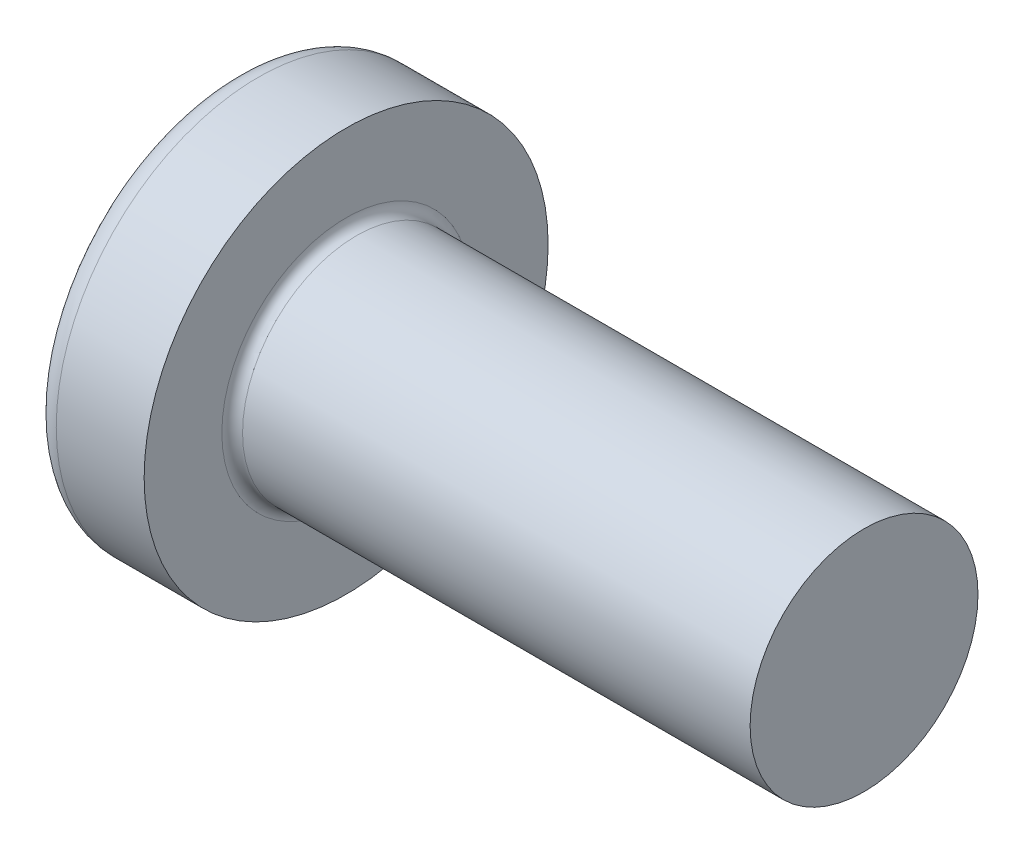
ISO-10303-21;
HEADER;
FILE_DESCRIPTION(('STEP AP214'),'2;1');
FILE_NAME('part.step','',(''),(''),'','','');
FILE_SCHEMA(('AUTOMOTIVE_DESIGN { 1 0 10303 214 1 1 1 1 }'));
ENDSEC;
DATA;
#1=APPLICATION_CONTEXT('core data for automotive mechanical design processes');
#2=APPLICATION_PROTOCOL_DEFINITION('international standard','automotive_design',2000,#1);
#3=PRODUCT_CONTEXT('',#1,'mechanical');
#4=PRODUCT('Part','Part','',(#3));
#5=PRODUCT_RELATED_PRODUCT_CATEGORY('part','',(#4));
#6=PRODUCT_DEFINITION_FORMATION('','',#4);
#7=PRODUCT_DEFINITION_CONTEXT('part definition',#1,'design');
#8=PRODUCT_DEFINITION('design','',#6,#7);
#9=PRODUCT_DEFINITION_SHAPE('','',#8);
#10=(LENGTH_UNIT() NAMED_UNIT(*) SI_UNIT(.MILLI.,.METRE.));
#11=(NAMED_UNIT(*) PLANE_ANGLE_UNIT() SI_UNIT($,.RADIAN.));
#12=(NAMED_UNIT(*) SI_UNIT($,.STERADIAN.) SOLID_ANGLE_UNIT());
#13=UNCERTAINTY_MEASURE_WITH_UNIT(LENGTH_MEASURE(1.E-05),#10,'distance_accuracy_value','');
#14=(GEOMETRIC_REPRESENTATION_CONTEXT(3) GLOBAL_UNCERTAINTY_ASSIGNED_CONTEXT((#13)) GLOBAL_UNIT_ASSIGNED_CONTEXT((#10,
#11,#12)) REPRESENTATION_CONTEXT('',''));
#15=CARTESIAN_POINT('',(0.,0.,0.));
#16=DIRECTION('',(0.,0.,1.));
#17=DIRECTION('',(1.,0.,0.));
#18=AXIS2_PLACEMENT_3D('',#15,#16,#17);
#19=CARTESIAN_POINT('',(1.2,0.601702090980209,-0.3));
#20=DIRECTION('',(-1.,0.,0.));
#21=DIRECTION('',(0.,0.,1.));
#22=AXIS2_PLACEMENT_3D('',#19,#20,#21);
#23=PLANE('',#22);
#24=DIRECTION('',(0.,0.,-1.));
#25=VECTOR('',#24,1.);
#26=CARTESIAN_POINT('',(1.2,0.299999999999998,0.60170209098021));
#27=LINE('',#26,#25);
#28=CARTESIAN_POINT('',(1.2,0.300000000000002,-0.601702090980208));
#29=VERTEX_POINT('',#28);
#30=CARTESIAN_POINT('',(1.19999999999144,0.300000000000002,-0.468119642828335));
#31=VERTEX_POINT('',#30);
#32=EDGE_CURVE('E269',#29,#31,#27,.F.);
#33=ORIENTED_EDGE('',*,*,#32,.F.);
#34=DIRECTION('',(0.,1.,0.));
#35=VECTOR('',#34,1.);
#36=CARTESIAN_POINT('',(1.2,0.300000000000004,-0.601702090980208));
#37=LINE('',#36,#35);
#38=CARTESIAN_POINT('',(1.2,-0.299999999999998,-0.60170209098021));
#39=VERTEX_POINT('',#38);
#40=EDGE_CURVE('E274',#29,#39,#37,.F.);
#41=ORIENTED_EDGE('',*,*,#40,.T.);
#42=DIRECTION('',(0.,0.,1.));
#43=VECTOR('',#42,1.);
#44=CARTESIAN_POINT('',(1.2,-0.299999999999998,-0.601702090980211));
#45=LINE('',#44,#43);
#46=CARTESIAN_POINT('',(1.19999999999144,-0.299999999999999,-0.468119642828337));
#47=VERTEX_POINT('',#46);
#48=EDGE_CURVE('E321',#47,#39,#45,.F.);
#49=ORIENTED_EDGE('',*,*,#48,.F.);
#50=CARTESIAN_POINT('',(1.19999999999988,0.,0.));
#51=DIRECTION('',(-1.,0.,0.));
#52=DIRECTION('',(0.,0.,1.));
#53=AXIS2_PLACEMENT_3D('',#50,#51,#52);
#54=CIRCLE('',#53,0.556000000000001);
#55=EDGE_CURVE('E543',#47,#31,#54,.F.);
#56=ORIENTED_EDGE('',*,*,#55,.T.);
#57=EDGE_LOOP('',(#33,#41,#49,#56));
#58=FACE_BOUND('',#57,.T.);
#59=ADVANCED_FACE('F16',(#58),#23,.T.);
#60=CARTESIAN_POINT('',(1.2,0.601702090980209,-0.3));
#61=DIRECTION('',(-1.,0.,0.));
#62=DIRECTION('',(0.,0.,1.));
#63=AXIS2_PLACEMENT_3D('',#60,#61,#62);
#64=PLANE('',#63);
#65=DIRECTION('',(0.,1.,0.));
#66=VECTOR('',#65,1.);
#67=CARTESIAN_POINT('',(1.2,-0.60170209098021,0.3));
#68=LINE('',#67,#66);
#69=CARTESIAN_POINT('',(1.2,0.601702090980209,0.3));
#70=VERTEX_POINT('',#69);
#71=CARTESIAN_POINT('',(1.19999999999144,0.468119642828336,0.3));
#72=VERTEX_POINT('',#71);
#73=EDGE_CURVE('E139',#70,#72,#68,.F.);
#74=ORIENTED_EDGE('',*,*,#73,.F.);
#75=DIRECTION('',(0.,0.,1.));
#76=VECTOR('',#75,1.);
#77=CARTESIAN_POINT('',(1.2,0.601702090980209,0.3));
#78=LINE('',#77,#76);
#79=CARTESIAN_POINT('',(1.2,0.601702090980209,-0.3));
#80=VERTEX_POINT('',#79);
#81=EDGE_CURVE('E262',#70,#80,#78,.F.);
#82=ORIENTED_EDGE('',*,*,#81,.T.);
#83=DIRECTION('',(0.,1.,0.));
#84=VECTOR('',#83,1.);
#85=CARTESIAN_POINT('',(1.2,0.601702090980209,-0.3));
#86=LINE('',#85,#84);
#87=CARTESIAN_POINT('',(1.19999999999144,0.468119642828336,-0.3));
#88=VERTEX_POINT('',#87);
#89=EDGE_CURVE('E142',#88,#80,#86,.T.);
#90=ORIENTED_EDGE('',*,*,#89,.F.);
#91=CARTESIAN_POINT('',(1.19999999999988,0.,0.));
#92=DIRECTION('',(-1.,0.,0.));
#93=DIRECTION('',(0.,0.,1.));
#94=AXIS2_PLACEMENT_3D('',#91,#92,#93);
#95=CIRCLE('',#94,0.556000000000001);
#96=EDGE_CURVE('E136',#88,#72,#95,.F.);
#97=ORIENTED_EDGE('',*,*,#96,.T.);
#98=EDGE_LOOP('',(#74,#82,#90,#97));
#99=FACE_BOUND('',#98,.T.);
#100=ADVANCED_FACE('F138',(#99),#64,.T.);
#101=CARTESIAN_POINT('',(1.2,0.601702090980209,-0.3));
#102=DIRECTION('',(-1.,0.,0.));
#103=DIRECTION('',(0.,0.,1.));
#104=AXIS2_PLACEMENT_3D('',#101,#102,#103);
#105=PLANE('',#104);
#106=DIRECTION('',(0.,0.,1.));
#107=VECTOR('',#106,1.);
#108=CARTESIAN_POINT('',(1.2,-0.299999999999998,-0.601702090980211));
#109=LINE('',#108,#107);
#110=CARTESIAN_POINT('',(1.2,-0.300000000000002,0.601702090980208));
#111=VERTEX_POINT('',#110);
#112=CARTESIAN_POINT('',(1.19999999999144,-0.300000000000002,0.468119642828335));
#113=VERTEX_POINT('',#112);
#114=EDGE_CURVE('E250',#111,#113,#109,.F.);
#115=ORIENTED_EDGE('',*,*,#114,.F.);
#116=DIRECTION('',(0.,1.,0.));
#117=VECTOR('',#116,1.);
#118=CARTESIAN_POINT('',(1.2,-0.300000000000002,0.601702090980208));
#119=LINE('',#118,#117);
#120=CARTESIAN_POINT('',(1.2,0.299999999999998,0.60170209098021));
#121=VERTEX_POINT('',#120);
#122=EDGE_CURVE('E255',#111,#121,#119,.T.);
#123=ORIENTED_EDGE('',*,*,#122,.T.);
#124=DIRECTION('',(0.,0.,-1.));
#125=VECTOR('',#124,1.);
#126=CARTESIAN_POINT('',(1.2,0.299999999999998,0.60170209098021));
#127=LINE('',#126,#125);
#128=CARTESIAN_POINT('',(1.19999999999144,0.299999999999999,0.468119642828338));
#129=VERTEX_POINT('',#128);
#130=EDGE_CURVE('E299',#129,#121,#127,.F.);
#131=ORIENTED_EDGE('',*,*,#130,.F.);
#132=CARTESIAN_POINT('',(1.19999999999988,0.,0.));
#133=DIRECTION('',(-1.,0.,0.));
#134=DIRECTION('',(0.,0.,1.));
#135=AXIS2_PLACEMENT_3D('',#132,#133,#134);
#136=CIRCLE('',#135,0.556000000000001);
#137=EDGE_CURVE('E148',#129,#113,#136,.F.);
#138=ORIENTED_EDGE('',*,*,#137,.T.);
#139=EDGE_LOOP('',(#115,#123,#131,#138));
#140=FACE_BOUND('',#139,.T.);
#141=ADVANCED_FACE('F558',(#140),#105,.T.);
#142=CARTESIAN_POINT('',(1.20000000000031,0.,0.));
#143=DIRECTION('',(-1.,0.,0.));
#144=DIRECTION('',(0.,0.,1.));
#145=AXIS2_PLACEMENT_3D('',#142,#143,#144);
#146=CONICAL_SURFACE('',#145,0.555999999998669,1.25663706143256);
#147=CARTESIAN_POINT('',(1.38065535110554,0.,0.));
#148=VERTEX_POINT('',#147);
#149=VERTEX_LOOP('',#148);
#150=FACE_BOUND('',#149,.T.);
#151=CARTESIAN_POINT('',(1.19999999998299,0.,0.));
#152=DIRECTION('',(-1.,0.,0.));
#153=DIRECTION('',(0.,0.,1.));
#154=AXIS2_PLACEMENT_3D('',#151,#152,#153);
#155=CIRCLE('',#154,0.55600000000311);
#156=EDGE_CURVE('E268',#88,#31,#155,.T.);
#157=ORIENTED_EDGE('',*,*,#156,.T.);
#158=ORIENTED_EDGE('',*,*,#55,.F.);
#159=CARTESIAN_POINT('',(1.19999999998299,0.,0.));
#160=DIRECTION('',(-1.,0.,0.));
#161=DIRECTION('',(0.,0.,1.));
#162=AXIS2_PLACEMENT_3D('',#159,#160,#161);
#163=CIRCLE('',#162,0.55600000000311);
#164=CARTESIAN_POINT('',(1.19999999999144,-0.468119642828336,-0.300000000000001));
#165=VERTEX_POINT('',#164);
#166=EDGE_CURVE('E329',#47,#165,#163,.T.);
#167=ORIENTED_EDGE('',*,*,#166,.T.);
#168=CARTESIAN_POINT('',(1.19999999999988,0.,0.));
#169=DIRECTION('',(-1.,0.,0.));
#170=DIRECTION('',(0.,0.,1.));
#171=AXIS2_PLACEMENT_3D('',#168,#169,#170);
#172=CIRCLE('',#171,0.556000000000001);
#173=CARTESIAN_POINT('',(1.19999999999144,-0.468119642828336,0.3));
#174=VERTEX_POINT('',#173);
#175=EDGE_CURVE('E289',#174,#165,#172,.F.);
#176=ORIENTED_EDGE('',*,*,#175,.F.);
#177=CARTESIAN_POINT('',(1.19999999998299,0.,0.));
#178=DIRECTION('',(-1.,0.,0.));
#179=DIRECTION('',(0.,0.,1.));
#180=AXIS2_PLACEMENT_3D('',#177,#178,#179);
#181=CIRCLE('',#180,0.55600000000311);
#182=EDGE_CURVE('E249',#174,#113,#181,.T.);
#183=ORIENTED_EDGE('',*,*,#182,.T.);
#184=ORIENTED_EDGE('',*,*,#137,.F.);
#185=CARTESIAN_POINT('',(1.19999999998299,0.,0.));
#186=DIRECTION('',(-1.,0.,0.));
#187=DIRECTION('',(0.,0.,1.));
#188=AXIS2_PLACEMENT_3D('',#185,#186,#187);
#189=CIRCLE('',#188,0.55600000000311);
#190=EDGE_CURVE('E161',#129,#72,#189,.T.);
#191=ORIENTED_EDGE('',*,*,#190,.T.);
#192=ORIENTED_EDGE('',*,*,#96,.F.);
#193=EDGE_LOOP('',(#157,#158,#167,#176,#183,#184,#191,#192));
#194=FACE_BOUND('',#193,.T.);
#195=ADVANCED_FACE('F162',(#150,#194),#146,.F.);
#196=CARTESIAN_POINT('',(1.2,0.601702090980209,-0.3));
#197=DIRECTION('',(-1.,0.,0.));
#198=DIRECTION('',(0.,0.,1.));
#199=AXIS2_PLACEMENT_3D('',#196,#197,#198);
#200=PLANE('',#199);
#201=DIRECTION('',(0.,1.,0.));
#202=VECTOR('',#201,1.);
#203=CARTESIAN_POINT('',(1.2,0.601702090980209,-0.3));
#204=LINE('',#203,#202);
#205=CARTESIAN_POINT('',(1.2,-0.601702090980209,-0.3));
#206=VERTEX_POINT('',#205);
#207=EDGE_CURVE('E285',#206,#165,#204,.T.);
#208=ORIENTED_EDGE('',*,*,#207,.F.);
#209=DIRECTION('',(0.,0.,1.));
#210=VECTOR('',#209,1.);
#211=CARTESIAN_POINT('',(1.2,-0.601702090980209,-0.3));
#212=LINE('',#211,#210);
#213=CARTESIAN_POINT('',(1.2,-0.601702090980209,0.3));
#214=VERTEX_POINT('',#213);
#215=EDGE_CURVE('E237',#206,#214,#212,.T.);
#216=ORIENTED_EDGE('',*,*,#215,.T.);
#217=DIRECTION('',(0.,1.,0.));
#218=VECTOR('',#217,1.);
#219=CARTESIAN_POINT('',(1.2,-0.60170209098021,0.3));
#220=LINE('',#219,#218);
#221=EDGE_CURVE('E243',#174,#214,#220,.F.);
#222=ORIENTED_EDGE('',*,*,#221,.F.);
#223=ORIENTED_EDGE('',*,*,#175,.T.);
#224=EDGE_LOOP('',(#208,#216,#222,#223));
#225=FACE_BOUND('',#224,.T.);
#226=ADVANCED_FACE('F547',(#225),#200,.T.);
#227=CARTESIAN_POINT('',(1.2,0.601702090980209,-0.3));
#228=DIRECTION('',(0.,0.,1.));
#229=DIRECTION('',(1.,0.,0.));
#230=AXIS2_PLACEMENT_3D('',#227,#228,#229);
#231=PLANE('',#230);
#232=CARTESIAN_POINT('',(0.170303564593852,-1.1150897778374,-0.300000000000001));
#233=CARTESIAN_POINT('',(0.143844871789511,-1.02418894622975,-0.300000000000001));
#234=CARTESIAN_POINT('',(0.120668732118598,-0.932580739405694,-0.300000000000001));
#235=CARTESIAN_POINT('',(0.0808815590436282,-0.747949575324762,-0.299999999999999));
#236=CARTESIAN_POINT('',(0.0642705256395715,-0.654926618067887,-0.299999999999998));
#237=CARTESIAN_POINT('',(0.050942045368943,-0.561196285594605,-0.299999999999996));
#238=B_SPLINE_CURVE_WITH_KNOTS('',3,(#232,#233,#234,#235,#236,#237),.UNSPECIFIED.,.F.,.F.,(4,2,
4),(0.,0.283483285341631,0.566966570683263),.UNSPECIFIED.);
#239=CARTESIAN_POINT('',(0.170303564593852,-1.1150897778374,-0.3));
#240=VERTEX_POINT('',#239);
#241=CARTESIAN_POINT('',(0.0509420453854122,-0.561196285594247,-0.3));
#242=VERTEX_POINT('',#241);
#243=EDGE_CURVE('E236',#240,#242,#238,.T.);
#244=ORIENTED_EDGE('',*,*,#243,.F.);
#245=DIRECTION('',(0.89493436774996,0.446197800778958,0.));
#246=VECTOR('',#245,1.);
#247=CARTESIAN_POINT('',(0.,-1.2,-0.3));
#248=LINE('',#247,#246);
#249=EDGE_CURVE('E240',#240,#206,#248,.T.);
#250=ORIENTED_EDGE('',*,*,#249,.T.);
#251=ORIENTED_EDGE('',*,*,#207,.T.);
#252=CARTESIAN_POINT('',(1.19999999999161,-0.468119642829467,-0.3));
#253=CARTESIAN_POINT('',(1.00851907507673,-0.483987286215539,-0.3));
#254=CARTESIAN_POINT('',(0.817023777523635,-0.499677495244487,-0.3));
#255=CARTESIAN_POINT('',(0.434004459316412,-0.530703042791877,-0.3));
#256=CARTESIAN_POINT('',(0.242480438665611,-0.546038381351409,-0.3));
#257=CARTESIAN_POINT('',(0.0509420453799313,-0.561196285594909,-0.3));
#258=B_SPLINE_CURVE_WITH_KNOTS('',3,(#252,#253,#254,#255,#256,#257),.UNSPECIFIED.,.F.,.F.,(4,2,
4),(0.,0.576411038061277,1.15282200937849),.UNSPECIFIED.);
#259=EDGE_CURVE('E288',#165,#242,#258,.T.);
#260=ORIENTED_EDGE('',*,*,#259,.T.);
#261=EDGE_LOOP('',(#244,#250,#251,#260));
#262=FACE_BOUND('',#261,.T.);
#263=ADVANCED_FACE('F469',(#262),#231,.T.);
#264=CARTESIAN_POINT('',(0.0509420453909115,0.,0.));
#265=DIRECTION('',(-1.,0.,0.));
#266=DIRECTION('',(0.,0.,1.));
#267=AXIS2_PLACEMENT_3D('',#264,#265,#266);
#268=CONICAL_SURFACE('',#267,0.636349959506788,0.0698131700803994);
#269=CARTESIAN_POINT('',(0.0509420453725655,-0.299999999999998,-0.561196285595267));
#270=CARTESIAN_POINT('',(0.242480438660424,-0.299999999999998,-0.546038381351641));
#271=CARTESIAN_POINT('',(0.434004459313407,-0.299999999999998,-0.530703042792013));
#272=CARTESIAN_POINT('',(0.817023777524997,-0.299999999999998,-0.499677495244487));
#273=CARTESIAN_POINT('',(1.00851907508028,-0.299999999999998,-0.4839872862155));
#274=CARTESIAN_POINT('',(1.19999999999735,-0.299999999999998,-0.468119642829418));
#275=B_SPLINE_CURVE_WITH_KNOTS('',3,(#269,#270,#271,#272,#273,#274),.UNSPECIFIED.,.F.,.F.,(4,2,
4),(0.,0.576410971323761,1.15282200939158),.UNSPECIFIED.);
#276=CARTESIAN_POINT('',(0.0509420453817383,-0.299999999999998,-0.561196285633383));
#277=VERTEX_POINT('',#276);
#278=EDGE_CURVE('E326',#277,#47,#275,.T.);
#279=ORIENTED_EDGE('',*,*,#278,.F.);
#280=CARTESIAN_POINT('',(0.0509420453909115,0.,0.));
#281=DIRECTION('',(-1.,0.,0.));
#282=DIRECTION('',(0.,0.,1.));
#283=AXIS2_PLACEMENT_3D('',#280,#281,#282);
#284=CIRCLE('',#283,0.636349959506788);
#285=EDGE_CURVE('E461',#242,#277,#284,.F.);
#286=ORIENTED_EDGE('',*,*,#285,.F.);
#287=ORIENTED_EDGE('',*,*,#259,.F.);
#288=ORIENTED_EDGE('',*,*,#166,.F.);
#289=EDGE_LOOP('',(#279,#286,#287,#288));
#290=FACE_BOUND('',#289,.T.);
#291=ADVANCED_FACE('F442',(#290),#268,.F.);
#292=CARTESIAN_POINT('',(1.2,-0.299999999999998,-0.601702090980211));
#293=DIRECTION('',(0.,1.,0.));
#294=DIRECTION('',(0.,0.,1.));
#295=AXIS2_PLACEMENT_3D('',#292,#293,#294);
#296=PLANE('',#295);
#297=ORIENTED_EDGE('',*,*,#48,.T.);
#298=DIRECTION('',(-0.89493436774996,0.,-0.446197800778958));
#299=VECTOR('',#298,1.);
#300=CARTESIAN_POINT('',(0.,-0.299999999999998,-1.2));
#301=LINE('',#300,#299);
#302=CARTESIAN_POINT('',(0.170303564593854,-0.299999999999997,-1.1150897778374));
#303=VERTEX_POINT('',#302);
#304=EDGE_CURVE('E272',#39,#303,#301,.T.);
#305=ORIENTED_EDGE('',*,*,#304,.T.);
#306=CARTESIAN_POINT('',(4.,-0.299999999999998,0.));
#307=DIRECTION('',(0.,1.,0.));
#308=DIRECTION('',(0.,0.,1.));
#309=AXIS2_PLACEMENT_3D('',#306,#307,#308);
#310=CIRCLE('',#309,3.98873413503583);
#311=EDGE_CURVE('E459',#277,#303,#310,.F.);
#312=ORIENTED_EDGE('',*,*,#311,.F.);
#313=ORIENTED_EDGE('',*,*,#278,.T.);
#314=EDGE_LOOP('',(#297,#305,#312,#313));
#315=FACE_BOUND('',#314,.T.);
#316=ADVANCED_FACE('F444',(#315),#296,.T.);
#317=CARTESIAN_POINT('',(0.,0.300000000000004,-1.2));
#318=DIRECTION('',(0.446197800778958,0.,-0.89493436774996));
#319=DIRECTION('',(-0.89493436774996,0.,-0.446197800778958));
#320=AXIS2_PLACEMENT_3D('',#317,#318,#319);
#321=PLANE('',#320);
#322=ORIENTED_EDGE('',*,*,#40,.F.);
#323=DIRECTION('',(0.89493436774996,0.,0.446197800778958));
#324=VECTOR('',#323,1.);
#325=CARTESIAN_POINT('',(0.170303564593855,0.300000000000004,-1.1150897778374));
#326=LINE('',#325,#324);
#327=CARTESIAN_POINT('',(0.170303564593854,0.300000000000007,-1.1150897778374));
#328=VERTEX_POINT('',#327);
#329=EDGE_CURVE('E265',#328,#29,#326,.T.);
#330=ORIENTED_EDGE('',*,*,#329,.F.);
#331=CARTESIAN_POINT('',(0.170303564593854,-0.299999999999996,-1.1150897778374));
#332=CARTESIAN_POINT('',(0.163473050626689,-0.199999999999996,-1.11849534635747));
#333=CARTESIAN_POINT('',(0.160057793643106,-0.0999999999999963,-1.12019813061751));
#334=CARTESIAN_POINT('',(0.160057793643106,0.100000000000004,-1.12019813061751));
#335=CARTESIAN_POINT('',(0.163473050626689,0.200000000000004,-1.11849534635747));
#336=CARTESIAN_POINT('',(0.170303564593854,0.300000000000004,-1.1150897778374));
#337=B_SPLINE_CURVE_WITH_KNOTS('',3,(#331,#332,#333,#334,#335,#336),.UNSPECIFIED.,.F.,.F.,(4,2,
4),(0.,0.300218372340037,0.600436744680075),.UNSPECIFIED.);
#338=EDGE_CURVE('E453',#303,#328,#337,.T.);
#339=ORIENTED_EDGE('',*,*,#338,.F.);
#340=ORIENTED_EDGE('',*,*,#304,.F.);
#341=EDGE_LOOP('',(#322,#330,#339,#340));
#342=FACE_BOUND('',#341,.T.);
#343=ADVANCED_FACE('F447',(#342),#321,.F.);
#344=CARTESIAN_POINT('',(1.2,0.299999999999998,0.60170209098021));
#345=DIRECTION('',(0.,-1.,0.));
#346=DIRECTION('',(0.,0.,-1.));
#347=AXIS2_PLACEMENT_3D('',#344,#345,#346);
#348=PLANE('',#347);
#349=CARTESIAN_POINT('',(4.,0.300000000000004,0.));
#350=DIRECTION('',(0.,1.,0.));
#351=DIRECTION('',(0.,0.,1.));
#352=AXIS2_PLACEMENT_3D('',#349,#350,#351);
#353=CIRCLE('',#352,3.98873413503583);
#354=CARTESIAN_POINT('',(0.0509420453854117,0.300000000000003,-0.56119628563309));
#355=VERTEX_POINT('',#354);
#356=EDGE_CURVE('E407',#328,#355,#353,.T.);
#357=ORIENTED_EDGE('',*,*,#356,.F.);
#358=ORIENTED_EDGE('',*,*,#329,.T.);
#359=ORIENTED_EDGE('',*,*,#32,.T.);
#360=CARTESIAN_POINT('',(1.1999999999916,0.300000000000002,-0.468119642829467));
#361=CARTESIAN_POINT('',(1.00851907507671,0.300000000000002,-0.483987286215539));
#362=CARTESIAN_POINT('',(0.817023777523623,0.300000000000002,-0.499677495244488));
#363=CARTESIAN_POINT('',(0.434004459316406,0.300000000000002,-0.530703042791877));
#364=CARTESIAN_POINT('',(0.242480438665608,0.300000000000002,-0.546038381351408));
#365=CARTESIAN_POINT('',(0.0509420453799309,0.300000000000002,-0.561196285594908));
#366=B_SPLINE_CURVE_WITH_KNOTS('',3,(#360,#361,#362,#363,#364,#365),.UNSPECIFIED.,.F.,.F.,(4,2,
4),(0.,0.576411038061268,1.15282200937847),.UNSPECIFIED.);
#367=EDGE_CURVE('E315',#31,#355,#366,.T.);
#368=ORIENTED_EDGE('',*,*,#367,.T.);
#369=EDGE_LOOP('',(#357,#358,#359,#368));
#370=FACE_BOUND('',#369,.T.);
#371=ADVANCED_FACE('F422',(#370),#348,.T.);
#372=CARTESIAN_POINT('',(0.0509420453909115,0.,0.));
#373=DIRECTION('',(-1.,0.,0.));
#374=DIRECTION('',(0.,0.,1.));
#375=AXIS2_PLACEMENT_3D('',#372,#373,#374);
#376=CONICAL_SURFACE('',#375,0.636349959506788,0.0698131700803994);
#377=ORIENTED_EDGE('',*,*,#367,.F.);
#378=ORIENTED_EDGE('',*,*,#156,.F.);
#379=CARTESIAN_POINT('',(0.0509420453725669,0.561196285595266,-0.3));
#380=CARTESIAN_POINT('',(0.242480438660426,0.54603838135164,-0.3));
#381=CARTESIAN_POINT('',(0.434004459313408,0.530703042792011,-0.3));
#382=CARTESIAN_POINT('',(0.817023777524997,0.499677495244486,-0.3));
#383=CARTESIAN_POINT('',(1.00851907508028,0.483987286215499,-0.3));
#384=CARTESIAN_POINT('',(1.19999999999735,0.468119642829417,-0.3));
#385=B_SPLINE_CURVE_WITH_KNOTS('',3,(#379,#380,#381,#382,#383,#384),.UNSPECIFIED.,.F.,.F.,(4,2,
4),(0.,0.57641097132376,1.15282200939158),.UNSPECIFIED.);
#386=CARTESIAN_POINT('',(0.0509420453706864,0.561196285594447,-0.3));
#387=VERTEX_POINT('',#386);
#388=EDGE_CURVE('E186',#387,#88,#385,.T.);
#389=ORIENTED_EDGE('',*,*,#388,.F.);
#390=CARTESIAN_POINT('',(0.0509420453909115,0.,0.));
#391=DIRECTION('',(-1.,0.,0.));
#392=DIRECTION('',(0.,0.,1.));
#393=AXIS2_PLACEMENT_3D('',#390,#391,#392);
#394=CIRCLE('',#393,0.636349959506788);
#395=EDGE_CURVE('E406',#355,#387,#394,.F.);
#396=ORIENTED_EDGE('',*,*,#395,.F.);
#397=EDGE_LOOP('',(#377,#378,#389,#396));
#398=FACE_BOUND('',#397,.T.);
#399=ADVANCED_FACE('F416',(#398),#376,.F.);
#400=CARTESIAN_POINT('',(1.2,0.601702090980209,-0.3));
#401=DIRECTION('',(0.,0.,1.));
#402=DIRECTION('',(1.,0.,0.));
#403=AXIS2_PLACEMENT_3D('',#400,#401,#402);
#404=PLANE('',#403);
#405=ORIENTED_EDGE('',*,*,#89,.T.);
#406=DIRECTION('',(-0.89493436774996,0.446197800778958,0.));
#407=VECTOR('',#406,1.);
#408=CARTESIAN_POINT('',(1.2,0.601702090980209,-0.3));
#409=LINE('',#408,#407);
#410=CARTESIAN_POINT('',(0.170303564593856,1.1150897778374,-0.3));
#411=VERTEX_POINT('',#410);
#412=EDGE_CURVE('E158',#80,#411,#409,.T.);
#413=ORIENTED_EDGE('',*,*,#412,.T.);
#414=CARTESIAN_POINT('',(0.0509420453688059,0.561196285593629,-0.299999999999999));
#415=CARTESIAN_POINT('',(0.0642705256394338,0.65492661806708,-0.299999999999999));
#416=CARTESIAN_POINT('',(0.0808815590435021,0.747949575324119,-0.3));
#417=CARTESIAN_POINT('',(0.120668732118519,0.932580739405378,-0.3));
#418=CARTESIAN_POINT('',(0.143844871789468,1.0241889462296,-0.300000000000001));
#419=CARTESIAN_POINT('',(0.170303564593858,1.1150897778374,-0.300000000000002));
#420=B_SPLINE_CURVE_WITH_KNOTS('',3,(#414,#415,#416,#417,#418,#419),.UNSPECIFIED.,.F.,.F.,(4,2,
4),(0.,0.283483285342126,0.566966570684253),.UNSPECIFIED.);
#421=EDGE_CURVE('E403',#387,#411,#420,.T.);
#422=ORIENTED_EDGE('',*,*,#421,.F.);
#423=ORIENTED_EDGE('',*,*,#388,.T.);
#424=EDGE_LOOP('',(#405,#413,#422,#423));
#425=FACE_BOUND('',#424,.T.);
#426=ADVANCED_FACE('F413',(#425),#404,.T.);
#427=CARTESIAN_POINT('',(1.2,0.601702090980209,0.3));
#428=DIRECTION('',(0.446197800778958,0.89493436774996,0.));
#429=DIRECTION('',(-0.89493436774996,0.446197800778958,0.));
#430=AXIS2_PLACEMENT_3D('',#427,#428,#429);
#431=PLANE('',#430);
#432=ORIENTED_EDGE('',*,*,#81,.F.);
#433=DIRECTION('',(0.89493436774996,-0.446197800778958,0.));
#434=VECTOR('',#433,1.);
#435=CARTESIAN_POINT('',(0.170303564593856,1.1150897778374,0.3));
#436=LINE('',#435,#434);
#437=CARTESIAN_POINT('',(0.170303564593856,1.1150897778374,0.3));
#438=VERTEX_POINT('',#437);
#439=EDGE_CURVE('E157',#438,#70,#436,.T.);
#440=ORIENTED_EDGE('',*,*,#439,.F.);
#441=CARTESIAN_POINT('',(0.170303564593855,1.1150897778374,-0.3));
#442=CARTESIAN_POINT('',(0.163473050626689,1.11849534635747,-0.2));
#443=CARTESIAN_POINT('',(0.160057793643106,1.1201981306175,-0.1));
#444=CARTESIAN_POINT('',(0.160057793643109,1.12019813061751,0.100000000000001));
#445=CARTESIAN_POINT('',(0.163473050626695,1.11849534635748,0.200000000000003));
#446=CARTESIAN_POINT('',(0.170303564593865,1.11508977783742,0.300000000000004));
#447=B_SPLINE_CURVE_WITH_KNOTS('',3,(#441,#442,#443,#444,#445,#446),.UNSPECIFIED.,.F.,.F.,(4,2,
4),(0.,0.300218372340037,0.600436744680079),.UNSPECIFIED.);
#448=EDGE_CURVE('E208',#411,#438,#447,.T.);
#449=ORIENTED_EDGE('',*,*,#448,.F.);
#450=ORIENTED_EDGE('',*,*,#412,.F.);
#451=EDGE_LOOP('',(#432,#440,#449,#450));
#452=FACE_BOUND('',#451,.T.);
#453=ADVANCED_FACE('F197',(#452),#431,.F.);
#454=CARTESIAN_POINT('',(1.2,-0.60170209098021,0.3));
#455=DIRECTION('',(0.,0.,-1.));
#456=DIRECTION('',(-1.,0.,0.));
#457=AXIS2_PLACEMENT_3D('',#454,#455,#456);
#458=PLANE('',#457);
#459=CARTESIAN_POINT('',(0.170303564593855,1.1150897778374,0.299999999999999));
#460=CARTESIAN_POINT('',(0.143844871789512,1.02418894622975,0.3));
#461=CARTESIAN_POINT('',(0.120668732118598,0.932580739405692,0.300000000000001));
#462=CARTESIAN_POINT('',(0.080881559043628,0.747949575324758,0.299999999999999));
#463=CARTESIAN_POINT('',(0.0642705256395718,0.654926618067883,0.299999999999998));
#464=CARTESIAN_POINT('',(0.0509420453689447,0.561196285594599,0.299999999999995));
#465=B_SPLINE_CURVE_WITH_KNOTS('',3,(#459,#460,#461,#462,#463,#464),.UNSPECIFIED.,.F.,.F.,(4,2,
4),(0.,0.283483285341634,0.566966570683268),.UNSPECIFIED.);
#466=CARTESIAN_POINT('',(0.0509420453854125,0.561196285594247,0.3));
#467=VERTEX_POINT('',#466);
#468=EDGE_CURVE('E201',#438,#467,#465,.T.);
#469=ORIENTED_EDGE('',*,*,#468,.F.);
#470=ORIENTED_EDGE('',*,*,#439,.T.);
#471=ORIENTED_EDGE('',*,*,#73,.T.);
#472=CARTESIAN_POINT('',(1.19999999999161,0.468119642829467,0.3));
#473=CARTESIAN_POINT('',(1.00851907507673,0.483987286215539,0.3));
#474=CARTESIAN_POINT('',(0.817023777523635,0.499677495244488,0.3));
#475=CARTESIAN_POINT('',(0.434004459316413,0.530703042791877,0.3));
#476=CARTESIAN_POINT('',(0.242480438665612,0.546038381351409,0.3));
#477=CARTESIAN_POINT('',(0.0509420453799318,0.561196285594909,0.3));
#478=B_SPLINE_CURVE_WITH_KNOTS('',3,(#472,#473,#474,#475,#476,#477),.UNSPECIFIED.,.F.,.F.,(4,2,
4),(0.,0.576411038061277,1.15282200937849),.UNSPECIFIED.);
#479=EDGE_CURVE('E155',#72,#467,#478,.T.);
#480=ORIENTED_EDGE('',*,*,#479,.T.);
#481=EDGE_LOOP('',(#469,#470,#471,#480));
#482=FACE_BOUND('',#481,.T.);
#483=ADVANCED_FACE('F153',(#482),#458,.T.);
#484=CARTESIAN_POINT('',(0.0509420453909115,0.,0.));
#485=DIRECTION('',(-1.,0.,0.));
#486=DIRECTION('',(0.,0.,1.));
#487=AXIS2_PLACEMENT_3D('',#484,#485,#486);
#488=CONICAL_SURFACE('',#487,0.636349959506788,0.0698131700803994);
#489=CARTESIAN_POINT('',(0.0509420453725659,0.299999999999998,0.561196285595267));
#490=CARTESIAN_POINT('',(0.242480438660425,0.299999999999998,0.546038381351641));
#491=CARTESIAN_POINT('',(0.434004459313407,0.299999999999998,0.530703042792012));
#492=CARTESIAN_POINT('',(0.817023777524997,0.299999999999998,0.499677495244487));
#493=CARTESIAN_POINT('',(1.00851907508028,0.299999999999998,0.4839872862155));
#494=CARTESIAN_POINT('',(1.19999999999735,0.299999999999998,0.468119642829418));
#495=B_SPLINE_CURVE_WITH_KNOTS('',3,(#489,#490,#491,#492,#493,#494),.UNSPECIFIED.,.F.,.F.,(4,2,
4),(0.,0.576410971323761,1.15282200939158),.UNSPECIFIED.);
#496=CARTESIAN_POINT('',(0.0509420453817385,0.299999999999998,0.561196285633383));
#497=VERTEX_POINT('',#496);
#498=EDGE_CURVE('E166',#497,#129,#495,.T.);
#499=ORIENTED_EDGE('',*,*,#498,.F.);
#500=CARTESIAN_POINT('',(0.0509420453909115,0.,0.));
#501=DIRECTION('',(-1.,0.,0.));
#502=DIRECTION('',(0.,0.,1.));
#503=AXIS2_PLACEMENT_3D('',#500,#501,#502);
#504=CIRCLE('',#503,0.636349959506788);
#505=EDGE_CURVE('E170',#467,#497,#504,.F.);
#506=ORIENTED_EDGE('',*,*,#505,.F.);
#507=ORIENTED_EDGE('',*,*,#479,.F.);
#508=ORIENTED_EDGE('',*,*,#190,.F.);
#509=EDGE_LOOP('',(#499,#506,#507,#508));
#510=FACE_BOUND('',#509,.T.);
#511=ADVANCED_FACE('F168',(#510),#488,.F.);
#512=CARTESIAN_POINT('',(1.2,0.299999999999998,0.60170209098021));
#513=DIRECTION('',(0.,-1.,0.));
#514=DIRECTION('',(0.,0.,-1.));
#515=AXIS2_PLACEMENT_3D('',#512,#513,#514);
#516=PLANE('',#515);
#517=ORIENTED_EDGE('',*,*,#130,.T.);
#518=DIRECTION('',(0.89493436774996,0.,-0.446197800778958));
#519=VECTOR('',#518,1.);
#520=CARTESIAN_POINT('',(1.2,0.299999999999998,0.60170209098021));
#521=LINE('',#520,#519);
#522=CARTESIAN_POINT('',(0.170303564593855,0.299999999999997,1.1150897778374));
#523=VERTEX_POINT('',#522);
#524=EDGE_CURVE('E253',#121,#523,#521,.F.);
#525=ORIENTED_EDGE('',*,*,#524,.T.);
#526=CARTESIAN_POINT('',(4.,0.299999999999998,0.));
#527=DIRECTION('',(0.,1.,0.));
#528=DIRECTION('',(0.,0.,1.));
#529=AXIS2_PLACEMENT_3D('',#526,#527,#528);
#530=CIRCLE('',#529,3.98873413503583);
#531=EDGE_CURVE('E395',#497,#523,#530,.T.);
#532=ORIENTED_EDGE('',*,*,#531,.F.);
#533=ORIENTED_EDGE('',*,*,#498,.T.);
#534=EDGE_LOOP('',(#517,#525,#532,#533));
#535=FACE_BOUND('',#534,.T.);
#536=ADVANCED_FACE('F386',(#535),#516,.T.);
#537=CARTESIAN_POINT('',(1.2,-0.300000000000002,0.601702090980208));
#538=DIRECTION('',(0.446197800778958,0.,0.89493436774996));
#539=DIRECTION('',(0.89493436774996,0.,-0.446197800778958));
#540=AXIS2_PLACEMENT_3D('',#537,#538,#539);
#541=PLANE('',#540);
#542=ORIENTED_EDGE('',*,*,#122,.F.);
#543=DIRECTION('',(0.89493436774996,0.,-0.446197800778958));
#544=VECTOR('',#543,1.);
#545=CARTESIAN_POINT('',(0.170303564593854,-0.300000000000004,1.1150897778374));
#546=LINE('',#545,#544);
#547=CARTESIAN_POINT('',(0.170303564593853,-0.300000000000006,1.1150897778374));
#548=VERTEX_POINT('',#547);
#549=EDGE_CURVE('E246',#548,#111,#546,.T.);
#550=ORIENTED_EDGE('',*,*,#549,.F.);
#551=CARTESIAN_POINT('',(0.170303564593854,0.299999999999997,1.1150897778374));
#552=CARTESIAN_POINT('',(0.163473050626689,0.199999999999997,1.11849534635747));
#553=CARTESIAN_POINT('',(0.160057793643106,0.0999999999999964,1.12019813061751));
#554=CARTESIAN_POINT('',(0.160057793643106,-0.100000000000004,1.12019813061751));
#555=CARTESIAN_POINT('',(0.163473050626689,-0.200000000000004,1.11849534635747));
#556=CARTESIAN_POINT('',(0.170303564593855,-0.300000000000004,1.1150897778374));
#557=B_SPLINE_CURVE_WITH_KNOTS('',3,(#551,#552,#553,#554,#555,#556),.UNSPECIFIED.,.F.,.F.,(4,2,
4),(0.,0.300218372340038,0.600436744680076),.UNSPECIFIED.);
#558=EDGE_CURVE('E389',#523,#548,#557,.T.);
#559=ORIENTED_EDGE('',*,*,#558,.F.);
#560=ORIENTED_EDGE('',*,*,#524,.F.);
#561=EDGE_LOOP('',(#542,#550,#559,#560));
#562=FACE_BOUND('',#561,.T.);
#563=ADVANCED_FACE('F382',(#562),#541,.F.);
#564=CARTESIAN_POINT('',(1.2,-0.299999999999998,-0.601702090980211));
#565=DIRECTION('',(0.,1.,0.));
#566=DIRECTION('',(0.,0.,1.));
#567=AXIS2_PLACEMENT_3D('',#564,#565,#566);
#568=PLANE('',#567);
#569=CARTESIAN_POINT('',(4.,-0.300000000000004,0.));
#570=DIRECTION('',(0.,1.,0.));
#571=DIRECTION('',(0.,0.,1.));
#572=AXIS2_PLACEMENT_3D('',#569,#570,#571);
#573=CIRCLE('',#572,3.98873413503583);
#574=CARTESIAN_POINT('',(0.0509420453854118,-0.300000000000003,0.561196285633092));
#575=VERTEX_POINT('',#574);
#576=EDGE_CURVE('E394',#548,#575,#573,.F.);
#577=ORIENTED_EDGE('',*,*,#576,.F.);
#578=ORIENTED_EDGE('',*,*,#549,.T.);
#579=ORIENTED_EDGE('',*,*,#114,.T.);
#580=CARTESIAN_POINT('',(1.1999999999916,-0.300000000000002,0.468119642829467));
#581=CARTESIAN_POINT('',(1.00851907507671,-0.300000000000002,0.483987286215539));
#582=CARTESIAN_POINT('',(0.817023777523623,-0.300000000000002,0.499677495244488));
#583=CARTESIAN_POINT('',(0.434004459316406,-0.300000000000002,0.530703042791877));
#584=CARTESIAN_POINT('',(0.242480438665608,-0.300000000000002,0.546038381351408));
#585=CARTESIAN_POINT('',(0.0509420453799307,-0.300000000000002,0.561196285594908));
#586=B_SPLINE_CURVE_WITH_KNOTS('',3,(#580,#581,#582,#583,#584,#585),.UNSPECIFIED.,.F.,.F.,(4,2,
4),(0.,0.576411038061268,1.15282200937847),.UNSPECIFIED.);
#587=EDGE_CURVE('E293',#113,#575,#586,.T.);
#588=ORIENTED_EDGE('',*,*,#587,.T.);
#589=EDGE_LOOP('',(#577,#578,#579,#588));
#590=FACE_BOUND('',#589,.T.);
#591=ADVANCED_FACE('F378',(#590),#568,.T.);
#592=CARTESIAN_POINT('',(0.0509420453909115,0.,0.));
#593=DIRECTION('',(-1.,0.,0.));
#594=DIRECTION('',(0.,0.,1.));
#595=AXIS2_PLACEMENT_3D('',#592,#593,#594);
#596=CONICAL_SURFACE('',#595,0.636349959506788,0.0698131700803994);
#597=ORIENTED_EDGE('',*,*,#587,.F.);
#598=ORIENTED_EDGE('',*,*,#182,.F.);
#599=CARTESIAN_POINT('',(0.0509420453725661,-0.561196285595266,0.3));
#600=CARTESIAN_POINT('',(0.242480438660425,-0.54603838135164,0.3));
#601=CARTESIAN_POINT('',(0.434004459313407,-0.530703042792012,0.3));
#602=CARTESIAN_POINT('',(0.817023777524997,-0.499677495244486,0.3));
#603=CARTESIAN_POINT('',(1.00851907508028,-0.483987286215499,0.3));
#604=CARTESIAN_POINT('',(1.19999999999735,-0.468119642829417,0.3));
#605=B_SPLINE_CURVE_WITH_KNOTS('',3,(#599,#600,#601,#602,#603,#604),.UNSPECIFIED.,.F.,.F.,(4,2,
4),(0.,0.576410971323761,1.15282200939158),.UNSPECIFIED.);
#606=CARTESIAN_POINT('',(0.050942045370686,-0.561196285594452,0.3));
#607=VERTEX_POINT('',#606);
#608=EDGE_CURVE('E279',#607,#174,#605,.T.);
#609=ORIENTED_EDGE('',*,*,#608,.F.);
#610=CARTESIAN_POINT('',(0.0509420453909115,0.,0.));
#611=DIRECTION('',(-1.,0.,0.));
#612=DIRECTION('',(0.,0.,1.));
#613=AXIS2_PLACEMENT_3D('',#610,#611,#612);
#614=CIRCLE('',#613,0.636349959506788);
#615=EDGE_CURVE('E353',#575,#607,#614,.F.);
#616=ORIENTED_EDGE('',*,*,#615,.F.);
#617=EDGE_LOOP('',(#597,#598,#609,#616));
#618=FACE_BOUND('',#617,.T.);
#619=ADVANCED_FACE('F359',(#618),#596,.F.);
#620=CARTESIAN_POINT('',(1.2,-0.60170209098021,0.3));
#621=DIRECTION('',(0.,0.,-1.));
#622=DIRECTION('',(-1.,0.,0.));
#623=AXIS2_PLACEMENT_3D('',#620,#621,#622);
#624=PLANE('',#623);
#625=ORIENTED_EDGE('',*,*,#221,.T.);
#626=DIRECTION('',(0.89493436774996,0.446197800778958,0.));
#627=VECTOR('',#626,1.);
#628=CARTESIAN_POINT('',(0.,-1.2,0.3));
#629=LINE('',#628,#627);
#630=CARTESIAN_POINT('',(0.170303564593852,-1.1150897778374,0.3));
#631=VERTEX_POINT('',#630);
#632=EDGE_CURVE('E234',#214,#631,#629,.F.);
#633=ORIENTED_EDGE('',*,*,#632,.T.);
#634=CARTESIAN_POINT('',(0.0509420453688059,-0.561196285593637,0.300000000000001));
#635=CARTESIAN_POINT('',(0.0642705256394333,-0.654926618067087,0.3));
#636=CARTESIAN_POINT('',(0.080881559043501,-0.747949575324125,0.3));
#637=CARTESIAN_POINT('',(0.120668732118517,-0.932580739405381,0.3));
#638=CARTESIAN_POINT('',(0.143844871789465,-1.0241889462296,0.3));
#639=CARTESIAN_POINT('',(0.170303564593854,-1.11508977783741,0.300000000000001));
#640=B_SPLINE_CURVE_WITH_KNOTS('',3,(#634,#635,#636,#637,#638,#639),.UNSPECIFIED.,.F.,.F.,(4,2,
4),(0.,0.283483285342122,0.566966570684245),.UNSPECIFIED.);
#641=EDGE_CURVE('E347',#607,#631,#640,.T.);
#642=ORIENTED_EDGE('',*,*,#641,.F.);
#643=ORIENTED_EDGE('',*,*,#608,.T.);
#644=EDGE_LOOP('',(#625,#633,#642,#643));
#645=FACE_BOUND('',#644,.T.);
#646=ADVANCED_FACE('F355',(#645),#624,.T.);
#647=CARTESIAN_POINT('',(0.,-1.2,-0.3));
#648=DIRECTION('',(0.446197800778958,-0.89493436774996,0.));
#649=DIRECTION('',(0.89493436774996,0.446197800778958,0.));
#650=AXIS2_PLACEMENT_3D('',#647,#648,#649);
#651=PLANE('',#650);
#652=ORIENTED_EDGE('',*,*,#215,.F.);
#653=ORIENTED_EDGE('',*,*,#249,.F.);
#654=CARTESIAN_POINT('',(0.170303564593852,-1.1150897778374,0.3));
#655=CARTESIAN_POINT('',(0.16347305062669,-1.11849534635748,0.2));
#656=CARTESIAN_POINT('',(0.160057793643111,-1.12019813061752,0.0999999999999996));
#657=CARTESIAN_POINT('',(0.160057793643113,-1.12019813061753,-0.100000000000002));
#658=CARTESIAN_POINT('',(0.163473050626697,-1.11849534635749,-0.200000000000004));
#659=CARTESIAN_POINT('',(0.170303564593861,-1.11508977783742,-0.300000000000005));
#660=B_SPLINE_CURVE_WITH_KNOTS('',3,(#654,#655,#656,#657,#658,#659),.UNSPECIFIED.,.F.,.F.,(4,2,
4),(0.,0.300218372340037,0.60043674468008),.UNSPECIFIED.);
#661=EDGE_CURVE('E342',#631,#240,#660,.T.);
#662=ORIENTED_EDGE('',*,*,#661,.F.);
#663=ORIENTED_EDGE('',*,*,#632,.F.);
#664=EDGE_LOOP('',(#652,#653,#662,#663));
#665=FACE_BOUND('',#664,.T.);
#666=ADVANCED_FACE('F221',(#665),#651,.F.);
#667=CARTESIAN_POINT('',(4.,0.,0.));
#668=DIRECTION('',(0.,1.,0.));
#669=DIRECTION('',(1.,0.,0.));
#670=AXIS2_PLACEMENT_3D('',#667,#668,#669);
#671=SPHERICAL_SURFACE('',#670,4.);
#672=CARTESIAN_POINT('',(0.437599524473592,0.,0.));
#673=DIRECTION('',(-1.,0.,0.));
#674=DIRECTION('',(0.,0.,1.));
#675=AXIS2_PLACEMENT_3D('',#672,#673,#674);
#676=CIRCLE('',#675,1.81914893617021);
#677=CARTESIAN_POINT('',(0.437599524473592,0.,1.81914893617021));
#678=VERTEX_POINT('',#677);
#679=EDGE_CURVE('E338',#678,#678,#676,.F.);
#680=ORIENTED_EDGE('',*,*,#679,.F.);
#681=EDGE_LOOP('',(#680));
#682=FACE_BOUND('',#681,.T.);
#683=ORIENTED_EDGE('',*,*,#641,.T.);
#684=ORIENTED_EDGE('',*,*,#661,.T.);
#685=ORIENTED_EDGE('',*,*,#243,.T.);
#686=ORIENTED_EDGE('',*,*,#285,.T.);
#687=ORIENTED_EDGE('',*,*,#311,.T.);
#688=ORIENTED_EDGE('',*,*,#338,.T.);
#689=ORIENTED_EDGE('',*,*,#356,.T.);
#690=ORIENTED_EDGE('',*,*,#395,.T.);
#691=ORIENTED_EDGE('',*,*,#421,.T.);
#692=ORIENTED_EDGE('',*,*,#448,.T.);
#693=ORIENTED_EDGE('',*,*,#468,.T.);
#694=ORIENTED_EDGE('',*,*,#505,.T.);
#695=ORIENTED_EDGE('',*,*,#531,.T.);
#696=ORIENTED_EDGE('',*,*,#558,.T.);
#697=ORIENTED_EDGE('',*,*,#576,.T.);
#698=ORIENTED_EDGE('',*,*,#615,.T.);
#699=EDGE_LOOP('',(#683,#684,#685,#686,#687,#688,#689,#690,#691,#692,#693,#694,#695,#696,#697,#698));
#700=FACE_BOUND('',#699,.T.);
#701=ADVANCED_FACE('F214',(#682,#700),#671,.T.);
#702=CARTESIAN_POINT('',(0.651343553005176,0.,0.));
#703=DIRECTION('',(-1.,0.,0.));
#704=DIRECTION('',(0.,0.,1.));
#705=AXIS2_PLACEMENT_3D('',#702,#703,#704);
#706=TOROIDAL_SURFACE('',#705,1.71,0.24);
#707=ORIENTED_EDGE('',*,*,#679,.T.);
#708=EDGE_LOOP('',(#707));
#709=FACE_BOUND('',#708,.T.);
#710=CARTESIAN_POINT('',(0.651343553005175,0.,0.));
#711=DIRECTION('',(-1.,0.,0.));
#712=DIRECTION('',(0.,0.,1.));
#713=AXIS2_PLACEMENT_3D('',#710,#711,#712);
#714=CIRCLE('',#713,1.95);
#715=CARTESIAN_POINT('',(0.651343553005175,0.,1.95));
#716=VERTEX_POINT('',#715);
#717=EDGE_CURVE('E341',#716,#716,#714,.F.);
#718=ORIENTED_EDGE('',*,*,#717,.F.);
#719=EDGE_LOOP('',(#718));
#720=FACE_BOUND('',#719,.T.);
#721=ADVANCED_FACE('F220',(#709,#720),#706,.T.);
#722=CARTESIAN_POINT('',(-25.4,0.,0.));
#723=DIRECTION('',(-1.,0.,0.));
#724=DIRECTION('',(0.,0.,1.));
#725=AXIS2_PLACEMENT_3D('',#722,#723,#724);
#726=CYLINDRICAL_SURFACE('',#725,1.95);
#727=ORIENTED_EDGE('',*,*,#717,.T.);
#728=EDGE_LOOP('',(#727));
#729=FACE_BOUND('',#728,.T.);
#730=CARTESIAN_POINT('',(1.5,0.,0.));
#731=DIRECTION('',(-1.,0.,0.));
#732=DIRECTION('',(0.,0.,1.));
#733=AXIS2_PLACEMENT_3D('',#730,#731,#732);
#734=CIRCLE('',#733,1.95);
#735=CARTESIAN_POINT('',(1.5,0.,1.95));
#736=VERTEX_POINT('',#735);
#737=EDGE_CURVE('E335',#736,#736,#734,.T.);
#738=ORIENTED_EDGE('',*,*,#737,.T.);
#739=EDGE_LOOP('',(#738));
#740=FACE_BOUND('',#739,.T.);
#741=ADVANCED_FACE('F519',(#729,#740),#726,.T.);
#742=CARTESIAN_POINT('',(1.5,1.1,0.));
#743=DIRECTION('',(-1.,0.,0.));
#744=DIRECTION('',(0.,0.,1.));
#745=AXIS2_PLACEMENT_3D('',#742,#743,#744);
#746=PLANE('',#745);
#747=ORIENTED_EDGE('',*,*,#737,.F.);
#748=EDGE_LOOP('',(#747));
#749=FACE_BOUND('',#748,.T.);
#750=CARTESIAN_POINT('',(1.5,0.,0.));
#751=DIRECTION('',(1.,0.,0.));
#752=DIRECTION('',(0.,0.,1.));
#753=AXIS2_PLACEMENT_3D('',#750,#751,#752);
#754=CIRCLE('',#753,1.2);
#755=CARTESIAN_POINT('',(1.5,0.,-1.2));
#756=VERTEX_POINT('',#755);
#757=CARTESIAN_POINT('',(1.5,0.,1.2));
#758=VERTEX_POINT('',#757);
#759=EDGE_CURVE('E334',#756,#758,#754,.F.);
#760=ORIENTED_EDGE('',*,*,#759,.T.);
#761=CARTESIAN_POINT('',(1.5,0.,0.));
#762=DIRECTION('',(1.,0.,0.));
#763=DIRECTION('',(0.,0.,-1.));
#764=AXIS2_PLACEMENT_3D('',#761,#762,#763);
#765=CIRCLE('',#764,1.2);
#766=EDGE_CURVE('E35',#756,#758,#765,.T.);
#767=ORIENTED_EDGE('',*,*,#766,.F.);
#768=EDGE_LOOP('',(#760,#767));
#769=FACE_BOUND('',#768,.T.);
#770=ADVANCED_FACE('F511',(#749,#769),#746,.F.);
#771=CARTESIAN_POINT('',(6.5,1.1,0.));
#772=DIRECTION('',(1.,0.,0.));
#773=DIRECTION('',(0.,0.,-1.));
#774=AXIS2_PLACEMENT_3D('',#771,#772,#773);
#775=PLANE('',#774);
#776=CARTESIAN_POINT('',(6.5,0.,0.));
#777=DIRECTION('',(-1.,0.,0.));
#778=DIRECTION('',(0.,0.,1.));
#779=AXIS2_PLACEMENT_3D('',#776,#777,#778);
#780=CIRCLE('',#779,1.1);
#781=CARTESIAN_POINT('',(6.5,0.,1.1));
#782=VERTEX_POINT('',#781);
#783=EDGE_CURVE('E27',#782,#782,#780,.T.);
#784=ORIENTED_EDGE('',*,*,#783,.F.);
#785=EDGE_LOOP('',(#784));
#786=FACE_BOUND('',#785,.T.);
#787=ADVANCED_FACE('F496',(#786),#775,.T.);
#788=CARTESIAN_POINT('',(1.6,0.,0.));
#789=DIRECTION('',(-1.,0.,0.));
#790=DIRECTION('',(0.,0.,1.));
#791=AXIS2_PLACEMENT_3D('',#788,#789,#790);
#792=TOROIDAL_SURFACE('',#791,1.2,0.1);
#793=ORIENTED_EDGE('',*,*,#766,.T.);
#794=ORIENTED_EDGE('',*,*,#759,.F.);
#795=EDGE_LOOP('',(#793,#794));
#796=FACE_BOUND('',#795,.T.);
#797=CARTESIAN_POINT('',(1.6,0.,0.));
#798=DIRECTION('',(-1.,0.,0.));
#799=DIRECTION('',(0.,0.,1.));
#800=AXIS2_PLACEMENT_3D('',#797,#798,#799);
#801=CIRCLE('',#800,1.1);
#802=CARTESIAN_POINT('',(1.6,0.,1.1));
#803=VERTEX_POINT('',#802);
#804=EDGE_CURVE('E11',#803,#803,#801,.F.);
#805=ORIENTED_EDGE('',*,*,#804,.F.);
#806=EDGE_LOOP('',(#805));
#807=FACE_BOUND('',#806,.T.);
#808=ADVANCED_FACE('F490',(#796,#807),#792,.F.);
#809=CARTESIAN_POINT('',(-25.4,0.,0.));
#810=DIRECTION('',(-1.,0.,0.));
#811=DIRECTION('',(0.,0.,1.));
#812=AXIS2_PLACEMENT_3D('',#809,#810,#811);
#813=CYLINDRICAL_SURFACE('',#812,1.1);
#814=ORIENTED_EDGE('',*,*,#783,.T.);
#815=EDGE_LOOP('',(#814));
#816=FACE_BOUND('',#815,.T.);
#817=ORIENTED_EDGE('',*,*,#804,.T.);
#818=EDGE_LOOP('',(#817));
#819=FACE_BOUND('',#818,.T.);
#820=ADVANCED_FACE('F488',(#816,#819),#813,.T.);
#821=CLOSED_SHELL('',(#59,#100,#141,#195,#226,#263,#291,#316,#343,#371,#399,#426,#453,#483,#511,
#536,#563,#591,#619,#646,#666,#701,#721,#741,#770,#787,#808,#820));
#822=MANIFOLD_SOLID_BREP('B1',#821);
#823=ADVANCED_BREP_SHAPE_REPRESENTATION('',(#18,#822),#14);
#824=SHAPE_DEFINITION_REPRESENTATION(#9,#823);
ENDSEC;
END-ISO-10303-21;
